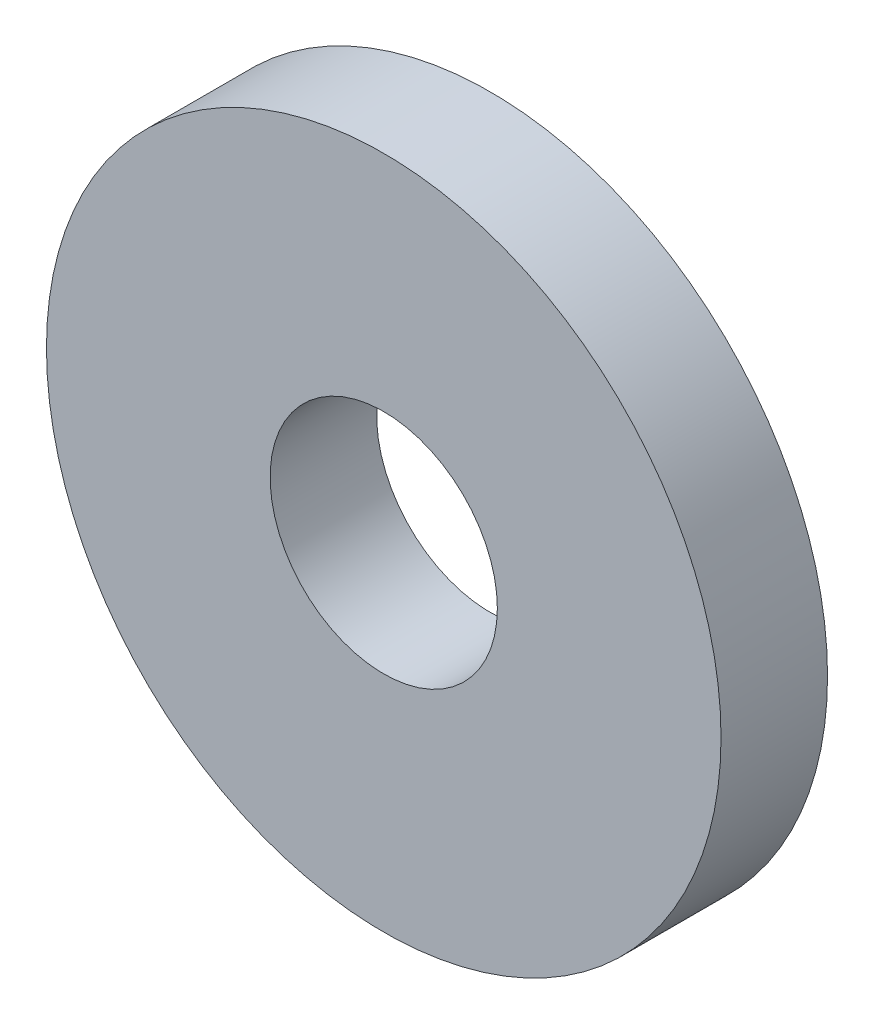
ISO-10303-21;
HEADER;
FILE_DESCRIPTION(('STEP AP214'),'2;1');
FILE_NAME('part.step','',(''),(''),'','','');
FILE_SCHEMA(('AUTOMOTIVE_DESIGN { 1 0 10303 214 1 1 1 1 }'));
ENDSEC;
DATA;
#1=APPLICATION_CONTEXT('core data for automotive mechanical design processes');
#2=APPLICATION_PROTOCOL_DEFINITION('international standard','automotive_design',2000,#1);
#3=PRODUCT_CONTEXT('',#1,'mechanical');
#4=PRODUCT('Part','Part','',(#3));
#5=PRODUCT_RELATED_PRODUCT_CATEGORY('part','',(#4));
#6=PRODUCT_DEFINITION_FORMATION('','',#4);
#7=PRODUCT_DEFINITION_CONTEXT('part definition',#1,'design');
#8=PRODUCT_DEFINITION('design','',#6,#7);
#9=PRODUCT_DEFINITION_SHAPE('','',#8);
#10=(LENGTH_UNIT() NAMED_UNIT(*) SI_UNIT(.MILLI.,.METRE.));
#11=(NAMED_UNIT(*) PLANE_ANGLE_UNIT() SI_UNIT($,.RADIAN.));
#12=(NAMED_UNIT(*) SI_UNIT($,.STERADIAN.) SOLID_ANGLE_UNIT());
#13=UNCERTAINTY_MEASURE_WITH_UNIT(LENGTH_MEASURE(1.E-05),#10,'distance_accuracy_value','');
#14=(GEOMETRIC_REPRESENTATION_CONTEXT(3) GLOBAL_UNCERTAINTY_ASSIGNED_CONTEXT((#13)) GLOBAL_UNIT_ASSIGNED_CONTEXT((#10,
#11,#12)) REPRESENTATION_CONTEXT('',''));
#15=CARTESIAN_POINT('',(0.,0.,0.));
#16=DIRECTION('',(0.,0.,1.));
#17=DIRECTION('',(1.,0.,0.));
#18=AXIS2_PLACEMENT_3D('',#15,#16,#17);
#19=CARTESIAN_POINT('',(0.,0.,3.));
#20=DIRECTION('',(0.,0.,1.));
#21=DIRECTION('',(1.,0.,0.));
#22=AXIS2_PLACEMENT_3D('',#19,#20,#21);
#23=PLANE('',#22);
#24=CARTESIAN_POINT('',(0.,0.,3.));
#25=DIRECTION('',(0.,0.,1.));
#26=DIRECTION('',(1.,0.,0.));
#27=AXIS2_PLACEMENT_3D('',#24,#25,#26);
#28=CIRCLE('',#27,9.5);
#29=CARTESIAN_POINT('',(9.5,0.,3.));
#30=VERTEX_POINT('',#29);
#31=EDGE_CURVE('E8',#30,#30,#28,.T.);
#32=ORIENTED_EDGE('',*,*,#31,.T.);
#33=EDGE_LOOP('',(#32));
#34=FACE_BOUND('',#33,.T.);
#35=CARTESIAN_POINT('',(0.,0.,3.));
#36=DIRECTION('',(0.,0.,1.));
#37=DIRECTION('',(1.,0.,0.));
#38=AXIS2_PLACEMENT_3D('',#35,#36,#37);
#39=CIRCLE('',#38,3.2);
#40=CARTESIAN_POINT('',(3.2,0.,3.));
#41=VERTEX_POINT('',#40);
#42=EDGE_CURVE('E23',#41,#41,#39,.T.);
#43=ORIENTED_EDGE('',*,*,#42,.F.);
#44=EDGE_LOOP('',(#43));
#45=FACE_BOUND('',#44,.T.);
#46=ADVANCED_FACE('F12',(#34,#45),#23,.T.);
#47=CARTESIAN_POINT('',(0.,0.,0.));
#48=DIRECTION('',(0.,0.,1.));
#49=DIRECTION('',(1.,0.,0.));
#50=AXIS2_PLACEMENT_3D('',#47,#48,#49);
#51=PLANE('',#50);
#52=CARTESIAN_POINT('',(0.,0.,0.));
#53=DIRECTION('',(0.,0.,1.));
#54=DIRECTION('',(1.,0.,0.));
#55=AXIS2_PLACEMENT_3D('',#52,#53,#54);
#56=CIRCLE('',#55,9.5);
#57=CARTESIAN_POINT('',(9.5,0.,0.));
#58=VERTEX_POINT('',#57);
#59=EDGE_CURVE('E19',#58,#58,#56,.T.);
#60=ORIENTED_EDGE('',*,*,#59,.F.);
#61=EDGE_LOOP('',(#60));
#62=FACE_BOUND('',#61,.T.);
#63=CARTESIAN_POINT('',(0.,0.,0.));
#64=DIRECTION('',(0.,0.,1.));
#65=DIRECTION('',(1.,0.,0.));
#66=AXIS2_PLACEMENT_3D('',#63,#64,#65);
#67=CIRCLE('',#66,3.2);
#68=CARTESIAN_POINT('',(3.2,0.,0.));
#69=VERTEX_POINT('',#68);
#70=EDGE_CURVE('E27',#69,#69,#67,.T.);
#71=ORIENTED_EDGE('',*,*,#70,.T.);
#72=EDGE_LOOP('',(#71));
#73=FACE_BOUND('',#72,.T.);
#74=ADVANCED_FACE('F33',(#62,#73),#51,.F.);
#75=CARTESIAN_POINT('',(0.,0.,3.));
#76=DIRECTION('',(0.,0.,-1.));
#77=DIRECTION('',(-1.,0.,0.));
#78=AXIS2_PLACEMENT_3D('',#75,#76,#77);
#79=CYLINDRICAL_SURFACE('',#78,9.5);
#80=ORIENTED_EDGE('',*,*,#31,.F.);
#81=EDGE_LOOP('',(#80));
#82=FACE_BOUND('',#81,.T.);
#83=ORIENTED_EDGE('',*,*,#59,.T.);
#84=EDGE_LOOP('',(#83));
#85=FACE_BOUND('',#84,.T.);
#86=ADVANCED_FACE('F14',(#82,#85),#79,.T.);
#87=CARTESIAN_POINT('',(0.,0.,3.));
#88=DIRECTION('',(0.,0.,-1.));
#89=DIRECTION('',(-1.,0.,0.));
#90=AXIS2_PLACEMENT_3D('',#87,#88,#89);
#91=CYLINDRICAL_SURFACE('',#90,3.2);
#92=ORIENTED_EDGE('',*,*,#42,.T.);
#93=EDGE_LOOP('',(#92));
#94=FACE_BOUND('',#93,.T.);
#95=ORIENTED_EDGE('',*,*,#70,.F.);
#96=EDGE_LOOP('',(#95));
#97=FACE_BOUND('',#96,.T.);
#98=ADVANCED_FACE('F35',(#94,#97),#91,.F.);
#99=CLOSED_SHELL('',(#46,#74,#86,#98));
#100=MANIFOLD_SOLID_BREP('B1',#99);
#101=ADVANCED_BREP_SHAPE_REPRESENTATION('',(#18,#100),#14);
#102=SHAPE_DEFINITION_REPRESENTATION(#9,#101);
ENDSEC;
END-ISO-10303-21;
